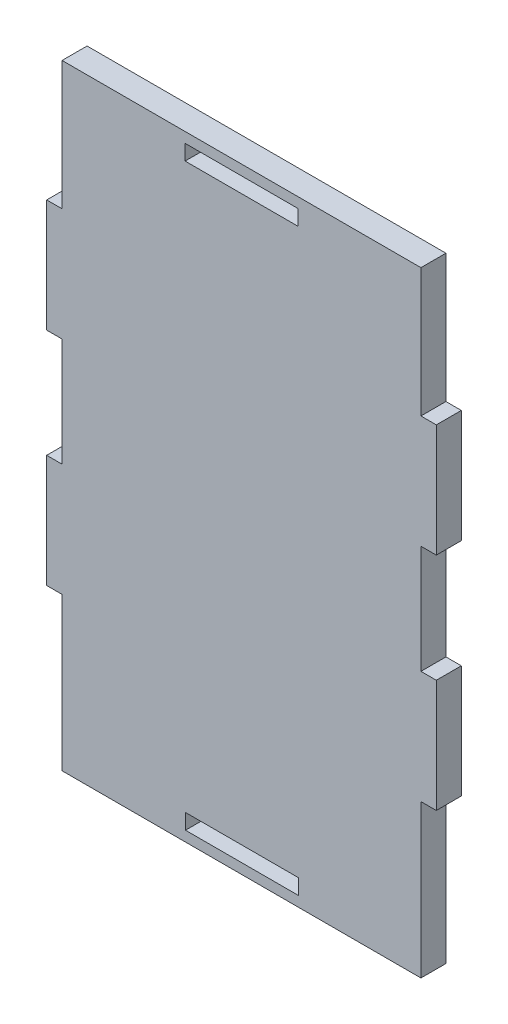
ISO-10303-21;
HEADER;
FILE_DESCRIPTION(('STEP AP214'),'2;1');
FILE_NAME('part.step','',(''),(''),'','','');
FILE_SCHEMA(('AUTOMOTIVE_DESIGN { 1 0 10303 214 1 1 1 1 }'));
ENDSEC;
DATA;
#1=APPLICATION_CONTEXT('core data for automotive mechanical design processes');
#2=APPLICATION_PROTOCOL_DEFINITION('international standard','automotive_design',2000,#1);
#3=PRODUCT_CONTEXT('',#1,'mechanical');
#4=PRODUCT('Part','Part','',(#3));
#5=PRODUCT_RELATED_PRODUCT_CATEGORY('part','',(#4));
#6=PRODUCT_DEFINITION_FORMATION('','',#4);
#7=PRODUCT_DEFINITION_CONTEXT('part definition',#1,'design');
#8=PRODUCT_DEFINITION('design','',#6,#7);
#9=PRODUCT_DEFINITION_SHAPE('','',#8);
#10=(LENGTH_UNIT() NAMED_UNIT(*) SI_UNIT(.MILLI.,.METRE.));
#11=(NAMED_UNIT(*) PLANE_ANGLE_UNIT() SI_UNIT($,.RADIAN.));
#12=(NAMED_UNIT(*) SI_UNIT($,.STERADIAN.) SOLID_ANGLE_UNIT());
#13=UNCERTAINTY_MEASURE_WITH_UNIT(LENGTH_MEASURE(1.E-05),#10,'distance_accuracy_value','');
#14=(GEOMETRIC_REPRESENTATION_CONTEXT(3) GLOBAL_UNCERTAINTY_ASSIGNED_CONTEXT((#13)) GLOBAL_UNIT_ASSIGNED_CONTEXT((#10,
#11,#12)) REPRESENTATION_CONTEXT('',''));
#15=CARTESIAN_POINT('',(0.,0.,0.));
#16=DIRECTION('',(0.,0.,1.));
#17=DIRECTION('',(1.,0.,0.));
#18=AXIS2_PLACEMENT_3D('',#15,#16,#17);
#19=CARTESIAN_POINT('',(0.,0.,4.87934888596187));
#20=DIRECTION('',(0.,0.,-1.));
#21=DIRECTION('',(-1.,0.,0.));
#22=AXIS2_PLACEMENT_3D('',#19,#20,#21);
#23=PLANE('',#22);
#24=DIRECTION('',(0.,-1.,0.));
#25=VECTOR('',#24,1.);
#26=CARTESIAN_POINT('',(23.9979341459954,-2.,4.87934888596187));
#27=LINE('',#26,#25);
#28=CARTESIAN_POINT('',(23.9979341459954,-2.,4.87934888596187));
#29=VERTEX_POINT('',#28);
#30=CARTESIAN_POINT('',(23.9979341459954,-5.,4.87934888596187));
#31=VERTEX_POINT('',#30);
#32=EDGE_CURVE('E256',#29,#31,#27,.T.);
#33=ORIENTED_EDGE('',*,*,#32,.F.);
#34=DIRECTION('',(-1.,0.,0.));
#35=VECTOR('',#34,1.);
#36=CARTESIAN_POINT('',(23.9979341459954,-2.,4.87934888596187));
#37=LINE('',#36,#35);
#38=CARTESIAN_POINT('',(45.9979341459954,-2.,4.87934888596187));
#39=VERTEX_POINT('',#38);
#40=EDGE_CURVE('E264',#39,#29,#37,.T.);
#41=ORIENTED_EDGE('',*,*,#40,.F.);
#42=DIRECTION('',(0.,1.,0.));
#43=VECTOR('',#42,1.);
#44=CARTESIAN_POINT('',(45.9979341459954,-2.,4.87934888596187));
#45=LINE('',#44,#43);
#46=CARTESIAN_POINT('',(45.9979341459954,-5.,4.87934888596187));
#47=VERTEX_POINT('',#46);
#48=EDGE_CURVE('E261',#47,#39,#45,.T.);
#49=ORIENTED_EDGE('',*,*,#48,.F.);
#50=DIRECTION('',(1.,0.,0.));
#51=VECTOR('',#50,1.);
#52=CARTESIAN_POINT('',(23.9979341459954,-5.,4.87934888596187));
#53=LINE('',#52,#51);
#54=EDGE_CURVE('E258',#31,#47,#53,.T.);
#55=ORIENTED_EDGE('',*,*,#54,.F.);
#56=EDGE_LOOP('',(#33,#41,#49,#55));
#57=FACE_BOUND('',#56,.T.);
#58=DIRECTION('',(0.,-1.,0.));
#59=VECTOR('',#58,1.);
#60=CARTESIAN_POINT('',(0.,0.,4.87934888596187));
#61=LINE('',#60,#59);
#62=CARTESIAN_POINT('',(0.,0.,4.87934888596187));
#63=VERTEX_POINT('',#62);
#64=CARTESIAN_POINT('',(0.,-25.06,4.87934888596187));
#65=VERTEX_POINT('',#64);
#66=EDGE_CURVE('E287',#63,#65,#61,.T.);
#67=ORIENTED_EDGE('',*,*,#66,.T.);
#68=DIRECTION('',(-1.,0.,0.));
#69=VECTOR('',#68,1.);
#70=CARTESIAN_POINT('',(0.,-25.06,4.87934888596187));
#71=LINE('',#70,#69);
#72=CARTESIAN_POINT('',(-3.,-25.06,4.87934888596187));
#73=VERTEX_POINT('',#72);
#74=EDGE_CURVE('E290',#65,#73,#71,.T.);
#75=ORIENTED_EDGE('',*,*,#74,.T.);
#76=DIRECTION('',(0.,-1.,0.));
#77=VECTOR('',#76,1.);
#78=CARTESIAN_POINT('',(-3.,-25.06,4.87934888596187));
#79=LINE('',#78,#77);
#80=CARTESIAN_POINT('',(-2.99999999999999,-47.06,4.87934888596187));
#81=VERTEX_POINT('',#80);
#82=EDGE_CURVE('E293',#73,#81,#79,.T.);
#83=ORIENTED_EDGE('',*,*,#82,.T.);
#84=DIRECTION('',(1.,0.,0.));
#85=VECTOR('',#84,1.);
#86=CARTESIAN_POINT('',(0.,-47.06,4.87934888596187));
#87=LINE('',#86,#85);
#88=CARTESIAN_POINT('',(0.,-47.06,4.87934888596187));
#89=VERTEX_POINT('',#88);
#90=EDGE_CURVE('E295',#81,#89,#87,.T.);
#91=ORIENTED_EDGE('',*,*,#90,.T.);
#92=DIRECTION('',(0.,-1.,0.));
#93=VECTOR('',#92,1.);
#94=CARTESIAN_POINT('',(0.,-47.06,4.87934888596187));
#95=LINE('',#94,#93);
#96=CARTESIAN_POINT('',(0.,-68.2,4.87934888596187));
#97=VERTEX_POINT('',#96);
#98=EDGE_CURVE('E297',#89,#97,#95,.T.);
#99=ORIENTED_EDGE('',*,*,#98,.T.);
#100=DIRECTION('',(-1.,0.,0.));
#101=VECTOR('',#100,1.);
#102=CARTESIAN_POINT('',(0.,-68.2,4.87934888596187));
#103=LINE('',#102,#101);
#104=CARTESIAN_POINT('',(-2.99999999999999,-68.2,4.87934888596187));
#105=VERTEX_POINT('',#104);
#106=EDGE_CURVE('E299',#97,#105,#103,.T.);
#107=ORIENTED_EDGE('',*,*,#106,.T.);
#108=DIRECTION('',(0.,-1.,0.));
#109=VECTOR('',#108,1.);
#110=CARTESIAN_POINT('',(-2.99999999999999,-68.2,4.87934888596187));
#111=LINE('',#110,#109);
#112=CARTESIAN_POINT('',(-2.99999999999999,-90.2,4.87934888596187));
#113=VERTEX_POINT('',#112);
#114=EDGE_CURVE('E301',#105,#113,#111,.T.);
#115=ORIENTED_EDGE('',*,*,#114,.T.);
#116=DIRECTION('',(1.,0.,0.));
#117=VECTOR('',#116,1.);
#118=CARTESIAN_POINT('',(0.,-90.2,4.87934888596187));
#119=LINE('',#118,#117);
#120=CARTESIAN_POINT('',(0.,-90.2,4.87934888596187));
#121=VERTEX_POINT('',#120);
#122=EDGE_CURVE('E303',#113,#121,#119,.T.);
#123=ORIENTED_EDGE('',*,*,#122,.T.);
#124=DIRECTION('',(0.,-1.,0.));
#125=VECTOR('',#124,1.);
#126=CARTESIAN_POINT('',(0.,-90.2,4.87934888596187));
#127=LINE('',#126,#125);
#128=CARTESIAN_POINT('',(0.,-120.,4.87934888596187));
#129=VERTEX_POINT('',#128);
#130=EDGE_CURVE('E305',#121,#129,#127,.T.);
#131=ORIENTED_EDGE('',*,*,#130,.T.);
#132=DIRECTION('',(1.,0.,0.));
#133=VECTOR('',#132,1.);
#134=CARTESIAN_POINT('',(0.,-120.,4.87934888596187));
#135=LINE('',#134,#133);
#136=CARTESIAN_POINT('',(70.,-120.,4.87934888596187));
#137=VERTEX_POINT('',#136);
#138=EDGE_CURVE('E307',#129,#137,#135,.T.);
#139=ORIENTED_EDGE('',*,*,#138,.T.);
#140=DIRECTION('',(0.,1.,0.));
#141=VECTOR('',#140,1.);
#142=CARTESIAN_POINT('',(70.,-90.1999999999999,4.87934888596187));
#143=LINE('',#142,#141);
#144=CARTESIAN_POINT('',(70.,-90.1999999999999,4.87934888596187));
#145=VERTEX_POINT('',#144);
#146=EDGE_CURVE('E309',#137,#145,#143,.T.);
#147=ORIENTED_EDGE('',*,*,#146,.T.);
#148=DIRECTION('',(1.,0.,0.));
#149=VECTOR('',#148,1.);
#150=CARTESIAN_POINT('',(70.,-90.1999999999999,4.87934888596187));
#151=LINE('',#150,#149);
#152=CARTESIAN_POINT('',(73.,-90.1999999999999,4.87934888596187));
#153=VERTEX_POINT('',#152);
#154=EDGE_CURVE('E311',#145,#153,#151,.T.);
#155=ORIENTED_EDGE('',*,*,#154,.T.);
#156=DIRECTION('',(0.,1.,0.));
#157=VECTOR('',#156,1.);
#158=CARTESIAN_POINT('',(73.,-68.2,4.87934888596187));
#159=LINE('',#158,#157);
#160=CARTESIAN_POINT('',(73.,-68.2,4.87934888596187));
#161=VERTEX_POINT('',#160);
#162=EDGE_CURVE('E313',#153,#161,#159,.T.);
#163=ORIENTED_EDGE('',*,*,#162,.T.);
#164=DIRECTION('',(-1.,0.,0.));
#165=VECTOR('',#164,1.);
#166=CARTESIAN_POINT('',(70.,-68.2,4.87934888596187));
#167=LINE('',#166,#165);
#168=CARTESIAN_POINT('',(70.,-68.2,4.87934888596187));
#169=VERTEX_POINT('',#168);
#170=EDGE_CURVE('E315',#161,#169,#167,.T.);
#171=ORIENTED_EDGE('',*,*,#170,.T.);
#172=DIRECTION('',(0.,1.,0.));
#173=VECTOR('',#172,1.);
#174=CARTESIAN_POINT('',(70.,-47.06,4.87934888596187));
#175=LINE('',#174,#173);
#176=CARTESIAN_POINT('',(70.,-47.06,4.87934888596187));
#177=VERTEX_POINT('',#176);
#178=EDGE_CURVE('E317',#169,#177,#175,.T.);
#179=ORIENTED_EDGE('',*,*,#178,.T.);
#180=DIRECTION('',(1.,0.,0.));
#181=VECTOR('',#180,1.);
#182=CARTESIAN_POINT('',(70.,-47.06,4.87934888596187));
#183=LINE('',#182,#181);
#184=CARTESIAN_POINT('',(73.,-47.06,4.87934888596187));
#185=VERTEX_POINT('',#184);
#186=EDGE_CURVE('E319',#177,#185,#183,.T.);
#187=ORIENTED_EDGE('',*,*,#186,.T.);
#188=DIRECTION('',(0.,1.,0.));
#189=VECTOR('',#188,1.);
#190=CARTESIAN_POINT('',(73.,-25.06,4.87934888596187));
#191=LINE('',#190,#189);
#192=CARTESIAN_POINT('',(73.,-25.06,4.87934888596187));
#193=VERTEX_POINT('',#192);
#194=EDGE_CURVE('E321',#185,#193,#191,.T.);
#195=ORIENTED_EDGE('',*,*,#194,.T.);
#196=DIRECTION('',(-1.,0.,0.));
#197=VECTOR('',#196,1.);
#198=CARTESIAN_POINT('',(70.,-25.06,4.87934888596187));
#199=LINE('',#198,#197);
#200=CARTESIAN_POINT('',(70.,-25.06,4.87934888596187));
#201=VERTEX_POINT('',#200);
#202=EDGE_CURVE('E323',#193,#201,#199,.T.);
#203=ORIENTED_EDGE('',*,*,#202,.T.);
#204=DIRECTION('',(0.,1.,0.));
#205=VECTOR('',#204,1.);
#206=CARTESIAN_POINT('',(70.,0.,4.87934888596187));
#207=LINE('',#206,#205);
#208=CARTESIAN_POINT('',(70.,0.,4.87934888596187));
#209=VERTEX_POINT('',#208);
#210=EDGE_CURVE('E325',#201,#209,#207,.T.);
#211=ORIENTED_EDGE('',*,*,#210,.T.);
#212=DIRECTION('',(-1.,0.,0.));
#213=VECTOR('',#212,1.);
#214=CARTESIAN_POINT('',(0.,0.,4.87934888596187));
#215=LINE('',#214,#213);
#216=EDGE_CURVE('E327',#209,#63,#215,.T.);
#217=ORIENTED_EDGE('',*,*,#216,.T.);
#218=EDGE_LOOP('',(#67,#75,#83,#91,#99,#107,#115,#123,#131,#139,#147,#155,#163,#171,#179,#187,
#195,#203,#211,#217));
#219=FACE_BOUND('',#218,.T.);
#220=DIRECTION('',(0.,-1.,0.));
#221=VECTOR('',#220,1.);
#222=CARTESIAN_POINT('',(24.0773037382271,-115.,4.87934888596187));
#223=LINE('',#222,#221);
#224=CARTESIAN_POINT('',(24.0773037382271,-115.,4.87934888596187));
#225=VERTEX_POINT('',#224);
#226=CARTESIAN_POINT('',(24.0773037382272,-118.,4.87934888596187));
#227=VERTEX_POINT('',#226);
#228=EDGE_CURVE('E220',#225,#227,#223,.T.);
#229=ORIENTED_EDGE('',*,*,#228,.F.);
#230=DIRECTION('',(-1.,0.,0.));
#231=VECTOR('',#230,1.);
#232=CARTESIAN_POINT('',(24.0773037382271,-115.,4.87934888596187));
#233=LINE('',#232,#231);
#234=CARTESIAN_POINT('',(46.0773037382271,-115.,4.87934888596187));
#235=VERTEX_POINT('',#234);
#236=EDGE_CURVE('E242',#235,#225,#233,.T.);
#237=ORIENTED_EDGE('',*,*,#236,.F.);
#238=DIRECTION('',(0.,1.,0.));
#239=VECTOR('',#238,1.);
#240=CARTESIAN_POINT('',(46.0773037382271,-115.,4.87934888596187));
#241=LINE('',#240,#239);
#242=CARTESIAN_POINT('',(46.0773037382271,-118.,4.87934888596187));
#243=VERTEX_POINT('',#242);
#244=EDGE_CURVE('E240',#243,#235,#241,.T.);
#245=ORIENTED_EDGE('',*,*,#244,.F.);
#246=DIRECTION('',(1.,0.,0.));
#247=VECTOR('',#246,1.);
#248=CARTESIAN_POINT('',(24.0773037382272,-118.,4.87934888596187));
#249=LINE('',#248,#247);
#250=EDGE_CURVE('E228',#227,#243,#249,.T.);
#251=ORIENTED_EDGE('',*,*,#250,.F.);
#252=EDGE_LOOP('',(#229,#237,#245,#251));
#253=FACE_BOUND('',#252,.T.);
#254=ADVANCED_FACE('F35',(#57,#219,#253),#23,.F.);
#255=CARTESIAN_POINT('',(0.,0.,0.));
#256=DIRECTION('',(0.,0.,-1.));
#257=DIRECTION('',(-1.,0.,0.));
#258=AXIS2_PLACEMENT_3D('',#255,#256,#257);
#259=PLANE('',#258);
#260=DIRECTION('',(0.,-1.,0.));
#261=VECTOR('',#260,1.);
#262=CARTESIAN_POINT('',(0.,0.,0.));
#263=LINE('',#262,#261);
#264=CARTESIAN_POINT('',(0.,0.,0.));
#265=VERTEX_POINT('',#264);
#266=CARTESIAN_POINT('',(0.,-25.06,0.));
#267=VERTEX_POINT('',#266);
#268=EDGE_CURVE('E286',#265,#267,#263,.T.);
#269=ORIENTED_EDGE('',*,*,#268,.F.);
#270=DIRECTION('',(-1.,0.,0.));
#271=VECTOR('',#270,1.);
#272=CARTESIAN_POINT('',(0.,0.,0.));
#273=LINE('',#272,#271);
#274=CARTESIAN_POINT('',(70.,0.,0.));
#275=VERTEX_POINT('',#274);
#276=EDGE_CURVE('E291',#275,#265,#273,.T.);
#277=ORIENTED_EDGE('',*,*,#276,.F.);
#278=DIRECTION('',(0.,1.,0.));
#279=VECTOR('',#278,1.);
#280=CARTESIAN_POINT('',(70.,0.,0.));
#281=LINE('',#280,#279);
#282=CARTESIAN_POINT('',(70.,-25.06,0.));
#283=VERTEX_POINT('',#282);
#284=EDGE_CURVE('E366',#283,#275,#281,.T.);
#285=ORIENTED_EDGE('',*,*,#284,.F.);
#286=DIRECTION('',(-1.,0.,0.));
#287=VECTOR('',#286,1.);
#288=CARTESIAN_POINT('',(70.,-25.06,0.));
#289=LINE('',#288,#287);
#290=CARTESIAN_POINT('',(73.,-25.06,0.));
#291=VERTEX_POINT('',#290);
#292=EDGE_CURVE('E364',#291,#283,#289,.T.);
#293=ORIENTED_EDGE('',*,*,#292,.F.);
#294=DIRECTION('',(0.,1.,0.));
#295=VECTOR('',#294,1.);
#296=CARTESIAN_POINT('',(73.,-25.06,0.));
#297=LINE('',#296,#295);
#298=CARTESIAN_POINT('',(73.,-47.06,0.));
#299=VERTEX_POINT('',#298);
#300=EDGE_CURVE('E362',#299,#291,#297,.T.);
#301=ORIENTED_EDGE('',*,*,#300,.F.);
#302=DIRECTION('',(1.,0.,0.));
#303=VECTOR('',#302,1.);
#304=CARTESIAN_POINT('',(70.,-47.06,0.));
#305=LINE('',#304,#303);
#306=CARTESIAN_POINT('',(70.,-47.06,0.));
#307=VERTEX_POINT('',#306);
#308=EDGE_CURVE('E360',#307,#299,#305,.T.);
#309=ORIENTED_EDGE('',*,*,#308,.F.);
#310=DIRECTION('',(0.,1.,0.));
#311=VECTOR('',#310,1.);
#312=CARTESIAN_POINT('',(70.,-47.06,0.));
#313=LINE('',#312,#311);
#314=CARTESIAN_POINT('',(70.,-68.2,0.));
#315=VERTEX_POINT('',#314);
#316=EDGE_CURVE('E358',#315,#307,#313,.T.);
#317=ORIENTED_EDGE('',*,*,#316,.F.);
#318=DIRECTION('',(-1.,0.,0.));
#319=VECTOR('',#318,1.);
#320=CARTESIAN_POINT('',(70.,-68.2,0.));
#321=LINE('',#320,#319);
#322=CARTESIAN_POINT('',(73.,-68.2,0.));
#323=VERTEX_POINT('',#322);
#324=EDGE_CURVE('E356',#323,#315,#321,.T.);
#325=ORIENTED_EDGE('',*,*,#324,.F.);
#326=DIRECTION('',(0.,1.,0.));
#327=VECTOR('',#326,1.);
#328=CARTESIAN_POINT('',(73.,-68.2,0.));
#329=LINE('',#328,#327);
#330=CARTESIAN_POINT('',(73.,-90.1999999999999,0.));
#331=VERTEX_POINT('',#330);
#332=EDGE_CURVE('E354',#331,#323,#329,.T.);
#333=ORIENTED_EDGE('',*,*,#332,.F.);
#334=DIRECTION('',(1.,0.,0.));
#335=VECTOR('',#334,1.);
#336=CARTESIAN_POINT('',(70.,-90.1999999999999,0.));
#337=LINE('',#336,#335);
#338=CARTESIAN_POINT('',(70.,-90.1999999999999,0.));
#339=VERTEX_POINT('',#338);
#340=EDGE_CURVE('E352',#339,#331,#337,.T.);
#341=ORIENTED_EDGE('',*,*,#340,.F.);
#342=DIRECTION('',(0.,1.,0.));
#343=VECTOR('',#342,1.);
#344=CARTESIAN_POINT('',(70.,-90.1999999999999,0.));
#345=LINE('',#344,#343);
#346=CARTESIAN_POINT('',(70.,-120.,0.));
#347=VERTEX_POINT('',#346);
#348=EDGE_CURVE('E350',#347,#339,#345,.T.);
#349=ORIENTED_EDGE('',*,*,#348,.F.);
#350=DIRECTION('',(1.,0.,0.));
#351=VECTOR('',#350,1.);
#352=CARTESIAN_POINT('',(0.,-120.,0.));
#353=LINE('',#352,#351);
#354=CARTESIAN_POINT('',(0.,-120.,0.));
#355=VERTEX_POINT('',#354);
#356=EDGE_CURVE('E348',#355,#347,#353,.T.);
#357=ORIENTED_EDGE('',*,*,#356,.F.);
#358=DIRECTION('',(0.,-1.,0.));
#359=VECTOR('',#358,1.);
#360=CARTESIAN_POINT('',(0.,-90.2,0.));
#361=LINE('',#360,#359);
#362=CARTESIAN_POINT('',(0.,-90.2,0.));
#363=VERTEX_POINT('',#362);
#364=EDGE_CURVE('E346',#363,#355,#361,.T.);
#365=ORIENTED_EDGE('',*,*,#364,.F.);
#366=DIRECTION('',(1.,0.,0.));
#367=VECTOR('',#366,1.);
#368=CARTESIAN_POINT('',(0.,-90.2,0.));
#369=LINE('',#368,#367);
#370=CARTESIAN_POINT('',(-2.99999999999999,-90.2,0.));
#371=VERTEX_POINT('',#370);
#372=EDGE_CURVE('E344',#371,#363,#369,.T.);
#373=ORIENTED_EDGE('',*,*,#372,.F.);
#374=DIRECTION('',(0.,-1.,0.));
#375=VECTOR('',#374,1.);
#376=CARTESIAN_POINT('',(-2.99999999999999,-68.2,0.));
#377=LINE('',#376,#375);
#378=CARTESIAN_POINT('',(-2.99999999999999,-68.2,0.));
#379=VERTEX_POINT('',#378);
#380=EDGE_CURVE('E342',#379,#371,#377,.T.);
#381=ORIENTED_EDGE('',*,*,#380,.F.);
#382=DIRECTION('',(-1.,0.,0.));
#383=VECTOR('',#382,1.);
#384=CARTESIAN_POINT('',(0.,-68.2,0.));
#385=LINE('',#384,#383);
#386=CARTESIAN_POINT('',(0.,-68.2,0.));
#387=VERTEX_POINT('',#386);
#388=EDGE_CURVE('E340',#387,#379,#385,.T.);
#389=ORIENTED_EDGE('',*,*,#388,.F.);
#390=DIRECTION('',(0.,-1.,0.));
#391=VECTOR('',#390,1.);
#392=CARTESIAN_POINT('',(0.,-47.06,0.));
#393=LINE('',#392,#391);
#394=CARTESIAN_POINT('',(0.,-47.06,0.));
#395=VERTEX_POINT('',#394);
#396=EDGE_CURVE('E338',#395,#387,#393,.T.);
#397=ORIENTED_EDGE('',*,*,#396,.F.);
#398=DIRECTION('',(1.,0.,0.));
#399=VECTOR('',#398,1.);
#400=CARTESIAN_POINT('',(0.,-47.06,0.));
#401=LINE('',#400,#399);
#402=CARTESIAN_POINT('',(-2.99999999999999,-47.06,0.));
#403=VERTEX_POINT('',#402);
#404=EDGE_CURVE('E336',#403,#395,#401,.T.);
#405=ORIENTED_EDGE('',*,*,#404,.F.);
#406=DIRECTION('',(0.,-1.,0.));
#407=VECTOR('',#406,1.);
#408=CARTESIAN_POINT('',(-3.,-25.06,0.));
#409=LINE('',#408,#407);
#410=CARTESIAN_POINT('',(-3.,-25.06,0.));
#411=VERTEX_POINT('',#410);
#412=EDGE_CURVE('E334',#411,#403,#409,.T.);
#413=ORIENTED_EDGE('',*,*,#412,.F.);
#414=DIRECTION('',(-1.,0.,0.));
#415=VECTOR('',#414,1.);
#416=CARTESIAN_POINT('',(0.,-25.06,0.));
#417=LINE('',#416,#415);
#418=EDGE_CURVE('E332',#267,#411,#417,.T.);
#419=ORIENTED_EDGE('',*,*,#418,.F.);
#420=EDGE_LOOP('',(#269,#277,#285,#293,#301,#309,#317,#325,#333,#341,#349,#357,#365,#373,#381,
#389,#397,#405,#413,#419));
#421=FACE_BOUND('',#420,.T.);
#422=DIRECTION('',(-1.,0.,0.));
#423=VECTOR('',#422,1.);
#424=CARTESIAN_POINT('',(23.9979341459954,-2.,0.));
#425=LINE('',#424,#423);
#426=CARTESIAN_POINT('',(45.9979341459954,-2.,0.));
#427=VERTEX_POINT('',#426);
#428=CARTESIAN_POINT('',(23.9979341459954,-2.,0.));
#429=VERTEX_POINT('',#428);
#430=EDGE_CURVE('E259',#427,#429,#425,.T.);
#431=ORIENTED_EDGE('',*,*,#430,.T.);
#432=DIRECTION('',(0.,-1.,0.));
#433=VECTOR('',#432,1.);
#434=CARTESIAN_POINT('',(23.9979341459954,-2.,0.));
#435=LINE('',#434,#433);
#436=CARTESIAN_POINT('',(23.9979341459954,-5.,0.));
#437=VERTEX_POINT('',#436);
#438=EDGE_CURVE('E236',#429,#437,#435,.T.);
#439=ORIENTED_EDGE('',*,*,#438,.T.);
#440=DIRECTION('',(1.,0.,0.));
#441=VECTOR('',#440,1.);
#442=CARTESIAN_POINT('',(23.9979341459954,-5.,0.));
#443=LINE('',#442,#441);
#444=CARTESIAN_POINT('',(45.9979341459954,-5.,0.));
#445=VERTEX_POINT('',#444);
#446=EDGE_CURVE('E269',#437,#445,#443,.T.);
#447=ORIENTED_EDGE('',*,*,#446,.T.);
#448=DIRECTION('',(0.,1.,0.));
#449=VECTOR('',#448,1.);
#450=CARTESIAN_POINT('',(45.9979341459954,-2.,0.));
#451=LINE('',#450,#449);
#452=EDGE_CURVE('E272',#445,#427,#451,.T.);
#453=ORIENTED_EDGE('',*,*,#452,.T.);
#454=EDGE_LOOP('',(#431,#439,#447,#453));
#455=FACE_BOUND('',#454,.T.);
#456=DIRECTION('',(-1.,0.,0.));
#457=VECTOR('',#456,1.);
#458=CARTESIAN_POINT('',(24.0773037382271,-115.,0.));
#459=LINE('',#458,#457);
#460=CARTESIAN_POINT('',(46.0773037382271,-115.,0.));
#461=VERTEX_POINT('',#460);
#462=CARTESIAN_POINT('',(24.0773037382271,-115.,0.));
#463=VERTEX_POINT('',#462);
#464=EDGE_CURVE('E229',#461,#463,#459,.T.);
#465=ORIENTED_EDGE('',*,*,#464,.T.);
#466=DIRECTION('',(0.,-1.,0.));
#467=VECTOR('',#466,1.);
#468=CARTESIAN_POINT('',(24.0773037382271,-115.,0.));
#469=LINE('',#468,#467);
#470=CARTESIAN_POINT('',(24.0773037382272,-118.,0.));
#471=VERTEX_POINT('',#470);
#472=EDGE_CURVE('E58',#463,#471,#469,.T.);
#473=ORIENTED_EDGE('',*,*,#472,.T.);
#474=DIRECTION('',(1.,0.,0.));
#475=VECTOR('',#474,1.);
#476=CARTESIAN_POINT('',(24.0773037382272,-118.,0.));
#477=LINE('',#476,#475);
#478=CARTESIAN_POINT('',(46.0773037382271,-118.,0.));
#479=VERTEX_POINT('',#478);
#480=EDGE_CURVE('E235',#471,#479,#477,.T.);
#481=ORIENTED_EDGE('',*,*,#480,.T.);
#482=DIRECTION('',(0.,1.,0.));
#483=VECTOR('',#482,1.);
#484=CARTESIAN_POINT('',(46.0773037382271,-115.,0.));
#485=LINE('',#484,#483);
#486=EDGE_CURVE('E248',#479,#461,#485,.T.);
#487=ORIENTED_EDGE('',*,*,#486,.T.);
#488=EDGE_LOOP('',(#465,#473,#481,#487));
#489=FACE_BOUND('',#488,.T.);
#490=ADVANCED_FACE('F432',(#421,#455,#489),#259,.T.);
#491=CARTESIAN_POINT('',(0.,0.,4.87934888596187));
#492=DIRECTION('',(1.,0.,0.));
#493=DIRECTION('',(0.,1.,0.));
#494=AXIS2_PLACEMENT_3D('',#491,#492,#493);
#495=PLANE('',#494);
#496=ORIENTED_EDGE('',*,*,#268,.T.);
#497=DIRECTION('',(0.,0.,-1.));
#498=VECTOR('',#497,1.);
#499=CARTESIAN_POINT('',(0.,-25.06,4.87934888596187));
#500=LINE('',#499,#498);
#501=EDGE_CURVE('E11',#65,#267,#500,.T.);
#502=ORIENTED_EDGE('',*,*,#501,.F.);
#503=ORIENTED_EDGE('',*,*,#66,.F.);
#504=DIRECTION('',(0.,0.,-1.));
#505=VECTOR('',#504,1.);
#506=CARTESIAN_POINT('',(0.,0.,4.87934888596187));
#507=LINE('',#506,#505);
#508=EDGE_CURVE('E329',#63,#265,#507,.T.);
#509=ORIENTED_EDGE('',*,*,#508,.T.);
#510=EDGE_LOOP('',(#496,#502,#503,#509));
#511=FACE_BOUND('',#510,.T.);
#512=ADVANCED_FACE('F37',(#511),#495,.F.);
#513=CARTESIAN_POINT('',(0.,-25.06,4.87934888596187));
#514=DIRECTION('',(0.,-1.,0.));
#515=DIRECTION('',(0.,0.,-1.));
#516=AXIS2_PLACEMENT_3D('',#513,#514,#515);
#517=PLANE('',#516);
#518=ORIENTED_EDGE('',*,*,#418,.T.);
#519=DIRECTION('',(0.,0.,-1.));
#520=VECTOR('',#519,1.);
#521=CARTESIAN_POINT('',(-3.,-25.06,4.87934888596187));
#522=LINE('',#521,#520);
#523=EDGE_CURVE('E43',#73,#411,#522,.T.);
#524=ORIENTED_EDGE('',*,*,#523,.F.);
#525=ORIENTED_EDGE('',*,*,#74,.F.);
#526=ORIENTED_EDGE('',*,*,#501,.T.);
#527=EDGE_LOOP('',(#518,#524,#525,#526));
#528=FACE_BOUND('',#527,.T.);
#529=ADVANCED_FACE('F449',(#528),#517,.F.);
#530=CARTESIAN_POINT('',(-3.,-25.06,4.87934888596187));
#531=DIRECTION('',(1.,0.,0.));
#532=DIRECTION('',(0.,1.,0.));
#533=AXIS2_PLACEMENT_3D('',#530,#531,#532);
#534=PLANE('',#533);
#535=ORIENTED_EDGE('',*,*,#412,.T.);
#536=DIRECTION('',(0.,0.,-1.));
#537=VECTOR('',#536,1.);
#538=CARTESIAN_POINT('',(-2.99999999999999,-47.06,4.87934888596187));
#539=LINE('',#538,#537);
#540=EDGE_CURVE('E419',#81,#403,#539,.T.);
#541=ORIENTED_EDGE('',*,*,#540,.F.);
#542=ORIENTED_EDGE('',*,*,#82,.F.);
#543=ORIENTED_EDGE('',*,*,#523,.T.);
#544=EDGE_LOOP('',(#535,#541,#542,#543));
#545=FACE_BOUND('',#544,.T.);
#546=ADVANCED_FACE('F426',(#545),#534,.F.);
#547=CARTESIAN_POINT('',(0.,-47.06,4.87934888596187));
#548=DIRECTION('',(0.,1.,0.));
#549=DIRECTION('',(0.,0.,1.));
#550=AXIS2_PLACEMENT_3D('',#547,#548,#549);
#551=PLANE('',#550);
#552=ORIENTED_EDGE('',*,*,#404,.T.);
#553=DIRECTION('',(0.,0.,-1.));
#554=VECTOR('',#553,1.);
#555=CARTESIAN_POINT('',(0.,-47.06,4.87934888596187));
#556=LINE('',#555,#554);
#557=EDGE_CURVE('E416',#89,#395,#556,.T.);
#558=ORIENTED_EDGE('',*,*,#557,.F.);
#559=ORIENTED_EDGE('',*,*,#90,.F.);
#560=ORIENTED_EDGE('',*,*,#540,.T.);
#561=EDGE_LOOP('',(#552,#558,#559,#560));
#562=FACE_BOUND('',#561,.T.);
#563=ADVANCED_FACE('F438',(#562),#551,.F.);
#564=CARTESIAN_POINT('',(0.,-47.06,4.87934888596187));
#565=DIRECTION('',(1.,0.,0.));
#566=DIRECTION('',(0.,1.,0.));
#567=AXIS2_PLACEMENT_3D('',#564,#565,#566);
#568=PLANE('',#567);
#569=ORIENTED_EDGE('',*,*,#396,.T.);
#570=DIRECTION('',(0.,0.,-1.));
#571=VECTOR('',#570,1.);
#572=CARTESIAN_POINT('',(0.,-68.2,4.87934888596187));
#573=LINE('',#572,#571);
#574=EDGE_CURVE('E413',#97,#387,#573,.T.);
#575=ORIENTED_EDGE('',*,*,#574,.F.);
#576=ORIENTED_EDGE('',*,*,#98,.F.);
#577=ORIENTED_EDGE('',*,*,#557,.T.);
#578=EDGE_LOOP('',(#569,#575,#576,#577));
#579=FACE_BOUND('',#578,.T.);
#580=ADVANCED_FACE('F442',(#579),#568,.F.);
#581=CARTESIAN_POINT('',(0.,-68.2,4.87934888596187));
#582=DIRECTION('',(0.,-1.,0.));
#583=DIRECTION('',(0.,0.,-1.));
#584=AXIS2_PLACEMENT_3D('',#581,#582,#583);
#585=PLANE('',#584);
#586=ORIENTED_EDGE('',*,*,#388,.T.);
#587=DIRECTION('',(0.,0.,-1.));
#588=VECTOR('',#587,1.);
#589=CARTESIAN_POINT('',(-2.99999999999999,-68.2,4.87934888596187));
#590=LINE('',#589,#588);
#591=EDGE_CURVE('E410',#105,#379,#590,.T.);
#592=ORIENTED_EDGE('',*,*,#591,.F.);
#593=ORIENTED_EDGE('',*,*,#106,.F.);
#594=ORIENTED_EDGE('',*,*,#574,.T.);
#595=EDGE_LOOP('',(#586,#592,#593,#594));
#596=FACE_BOUND('',#595,.T.);
#597=ADVANCED_FACE('F522',(#596),#585,.F.);
#598=CARTESIAN_POINT('',(-2.99999999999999,-68.2,4.87934888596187));
#599=DIRECTION('',(1.,0.,0.));
#600=DIRECTION('',(0.,1.,0.));
#601=AXIS2_PLACEMENT_3D('',#598,#599,#600);
#602=PLANE('',#601);
#603=ORIENTED_EDGE('',*,*,#380,.T.);
#604=DIRECTION('',(0.,0.,-1.));
#605=VECTOR('',#604,1.);
#606=CARTESIAN_POINT('',(-2.99999999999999,-90.2,4.87934888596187));
#607=LINE('',#606,#605);
#608=EDGE_CURVE('E407',#113,#371,#607,.T.);
#609=ORIENTED_EDGE('',*,*,#608,.F.);
#610=ORIENTED_EDGE('',*,*,#114,.F.);
#611=ORIENTED_EDGE('',*,*,#591,.T.);
#612=EDGE_LOOP('',(#603,#609,#610,#611));
#613=FACE_BOUND('',#612,.T.);
#614=ADVANCED_FACE('F520',(#613),#602,.F.);
#615=CARTESIAN_POINT('',(0.,-90.2,4.87934888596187));
#616=DIRECTION('',(0.,1.,0.));
#617=DIRECTION('',(0.,0.,1.));
#618=AXIS2_PLACEMENT_3D('',#615,#616,#617);
#619=PLANE('',#618);
#620=ORIENTED_EDGE('',*,*,#372,.T.);
#621=DIRECTION('',(0.,0.,-1.));
#622=VECTOR('',#621,1.);
#623=CARTESIAN_POINT('',(0.,-90.2,4.87934888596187));
#624=LINE('',#623,#622);
#625=EDGE_CURVE('E404',#121,#363,#624,.T.);
#626=ORIENTED_EDGE('',*,*,#625,.F.);
#627=ORIENTED_EDGE('',*,*,#122,.F.);
#628=ORIENTED_EDGE('',*,*,#608,.T.);
#629=EDGE_LOOP('',(#620,#626,#627,#628));
#630=FACE_BOUND('',#629,.T.);
#631=ADVANCED_FACE('F515',(#630),#619,.F.);
#632=CARTESIAN_POINT('',(0.,-90.2,4.87934888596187));
#633=DIRECTION('',(1.,0.,0.));
#634=DIRECTION('',(0.,1.,0.));
#635=AXIS2_PLACEMENT_3D('',#632,#633,#634);
#636=PLANE('',#635);
#637=ORIENTED_EDGE('',*,*,#364,.T.);
#638=DIRECTION('',(0.,0.,-1.));
#639=VECTOR('',#638,1.);
#640=CARTESIAN_POINT('',(0.,-120.,4.87934888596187));
#641=LINE('',#640,#639);
#642=EDGE_CURVE('E401',#129,#355,#641,.T.);
#643=ORIENTED_EDGE('',*,*,#642,.F.);
#644=ORIENTED_EDGE('',*,*,#130,.F.);
#645=ORIENTED_EDGE('',*,*,#625,.T.);
#646=EDGE_LOOP('',(#637,#643,#644,#645));
#647=FACE_BOUND('',#646,.T.);
#648=ADVANCED_FACE('F510',(#647),#636,.F.);
#649=CARTESIAN_POINT('',(0.,-120.,4.87934888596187));
#650=DIRECTION('',(0.,1.,0.));
#651=DIRECTION('',(0.,0.,1.));
#652=AXIS2_PLACEMENT_3D('',#649,#650,#651);
#653=PLANE('',#652);
#654=ORIENTED_EDGE('',*,*,#356,.T.);
#655=DIRECTION('',(0.,0.,-1.));
#656=VECTOR('',#655,1.);
#657=CARTESIAN_POINT('',(70.,-120.,4.87934888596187));
#658=LINE('',#657,#656);
#659=EDGE_CURVE('E398',#137,#347,#658,.T.);
#660=ORIENTED_EDGE('',*,*,#659,.F.);
#661=ORIENTED_EDGE('',*,*,#138,.F.);
#662=ORIENTED_EDGE('',*,*,#642,.T.);
#663=EDGE_LOOP('',(#654,#660,#661,#662));
#664=FACE_BOUND('',#663,.T.);
#665=ADVANCED_FACE('F506',(#664),#653,.F.);
#666=CARTESIAN_POINT('',(70.,-90.1999999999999,4.87934888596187));
#667=DIRECTION('',(-1.,0.,0.));
#668=DIRECTION('',(0.,-1.,0.));
#669=AXIS2_PLACEMENT_3D('',#666,#667,#668);
#670=PLANE('',#669);
#671=ORIENTED_EDGE('',*,*,#348,.T.);
#672=DIRECTION('',(0.,0.,-1.));
#673=VECTOR('',#672,1.);
#674=CARTESIAN_POINT('',(70.,-90.1999999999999,4.87934888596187));
#675=LINE('',#674,#673);
#676=EDGE_CURVE('E395',#145,#339,#675,.T.);
#677=ORIENTED_EDGE('',*,*,#676,.F.);
#678=ORIENTED_EDGE('',*,*,#146,.F.);
#679=ORIENTED_EDGE('',*,*,#659,.T.);
#680=EDGE_LOOP('',(#671,#677,#678,#679));
#681=FACE_BOUND('',#680,.T.);
#682=ADVANCED_FACE('F501',(#681),#670,.F.);
#683=CARTESIAN_POINT('',(70.,-90.1999999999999,4.87934888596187));
#684=DIRECTION('',(0.,1.,0.));
#685=DIRECTION('',(0.,0.,1.));
#686=AXIS2_PLACEMENT_3D('',#683,#684,#685);
#687=PLANE('',#686);
#688=ORIENTED_EDGE('',*,*,#340,.T.);
#689=DIRECTION('',(0.,0.,-1.));
#690=VECTOR('',#689,1.);
#691=CARTESIAN_POINT('',(73.,-90.1999999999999,4.87934888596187));
#692=LINE('',#691,#690);
#693=EDGE_CURVE('E392',#153,#331,#692,.T.);
#694=ORIENTED_EDGE('',*,*,#693,.F.);
#695=ORIENTED_EDGE('',*,*,#154,.F.);
#696=ORIENTED_EDGE('',*,*,#676,.T.);
#697=EDGE_LOOP('',(#688,#694,#695,#696));
#698=FACE_BOUND('',#697,.T.);
#699=ADVANCED_FACE('F495',(#698),#687,.F.);
#700=CARTESIAN_POINT('',(73.,-68.2,4.87934888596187));
#701=DIRECTION('',(-1.,0.,0.));
#702=DIRECTION('',(0.,0.,1.));
#703=AXIS2_PLACEMENT_3D('',#700,#701,#702);
#704=PLANE('',#703);
#705=ORIENTED_EDGE('',*,*,#332,.T.);
#706=DIRECTION('',(0.,0.,-1.));
#707=VECTOR('',#706,1.);
#708=CARTESIAN_POINT('',(73.,-68.2,4.87934888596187));
#709=LINE('',#708,#707);
#710=EDGE_CURVE('E389',#161,#323,#709,.T.);
#711=ORIENTED_EDGE('',*,*,#710,.F.);
#712=ORIENTED_EDGE('',*,*,#162,.F.);
#713=ORIENTED_EDGE('',*,*,#693,.T.);
#714=EDGE_LOOP('',(#705,#711,#712,#713));
#715=FACE_BOUND('',#714,.T.);
#716=ADVANCED_FACE('F491',(#715),#704,.F.);
#717=CARTESIAN_POINT('',(70.,-68.2,4.87934888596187));
#718=DIRECTION('',(0.,-1.,0.));
#719=DIRECTION('',(0.,0.,-1.));
#720=AXIS2_PLACEMENT_3D('',#717,#718,#719);
#721=PLANE('',#720);
#722=ORIENTED_EDGE('',*,*,#324,.T.);
#723=DIRECTION('',(0.,0.,-1.));
#724=VECTOR('',#723,1.);
#725=CARTESIAN_POINT('',(70.,-68.2,4.87934888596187));
#726=LINE('',#725,#724);
#727=EDGE_CURVE('E386',#169,#315,#726,.T.);
#728=ORIENTED_EDGE('',*,*,#727,.F.);
#729=ORIENTED_EDGE('',*,*,#170,.F.);
#730=ORIENTED_EDGE('',*,*,#710,.T.);
#731=EDGE_LOOP('',(#722,#728,#729,#730));
#732=FACE_BOUND('',#731,.T.);
#733=ADVANCED_FACE('F486',(#732),#721,.F.);
#734=CARTESIAN_POINT('',(70.,-47.06,4.87934888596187));
#735=DIRECTION('',(-1.,0.,0.));
#736=DIRECTION('',(0.,-1.,0.));
#737=AXIS2_PLACEMENT_3D('',#734,#735,#736);
#738=PLANE('',#737);
#739=ORIENTED_EDGE('',*,*,#316,.T.);
#740=DIRECTION('',(0.,0.,-1.));
#741=VECTOR('',#740,1.);
#742=CARTESIAN_POINT('',(70.,-47.06,4.87934888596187));
#743=LINE('',#742,#741);
#744=EDGE_CURVE('E383',#177,#307,#743,.T.);
#745=ORIENTED_EDGE('',*,*,#744,.F.);
#746=ORIENTED_EDGE('',*,*,#178,.F.);
#747=ORIENTED_EDGE('',*,*,#727,.T.);
#748=EDGE_LOOP('',(#739,#745,#746,#747));
#749=FACE_BOUND('',#748,.T.);
#750=ADVANCED_FACE('F480',(#749),#738,.F.);
#751=CARTESIAN_POINT('',(70.,-47.06,4.87934888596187));
#752=DIRECTION('',(0.,1.,0.));
#753=DIRECTION('',(0.,0.,1.));
#754=AXIS2_PLACEMENT_3D('',#751,#752,#753);
#755=PLANE('',#754);
#756=ORIENTED_EDGE('',*,*,#308,.T.);
#757=DIRECTION('',(0.,0.,-1.));
#758=VECTOR('',#757,1.);
#759=CARTESIAN_POINT('',(73.,-47.06,4.87934888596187));
#760=LINE('',#759,#758);
#761=EDGE_CURVE('E380',#185,#299,#760,.T.);
#762=ORIENTED_EDGE('',*,*,#761,.F.);
#763=ORIENTED_EDGE('',*,*,#186,.F.);
#764=ORIENTED_EDGE('',*,*,#744,.T.);
#765=EDGE_LOOP('',(#756,#762,#763,#764));
#766=FACE_BOUND('',#765,.T.);
#767=ADVANCED_FACE('F476',(#766),#755,.F.);
#768=CARTESIAN_POINT('',(73.,-25.06,4.87934888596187));
#769=DIRECTION('',(-1.,0.,0.));
#770=DIRECTION('',(0.,-1.,0.));
#771=AXIS2_PLACEMENT_3D('',#768,#769,#770);
#772=PLANE('',#771);
#773=ORIENTED_EDGE('',*,*,#300,.T.);
#774=DIRECTION('',(0.,0.,-1.));
#775=VECTOR('',#774,1.);
#776=CARTESIAN_POINT('',(73.,-25.06,4.87934888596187));
#777=LINE('',#776,#775);
#778=EDGE_CURVE('E377',#193,#291,#777,.T.);
#779=ORIENTED_EDGE('',*,*,#778,.F.);
#780=ORIENTED_EDGE('',*,*,#194,.F.);
#781=ORIENTED_EDGE('',*,*,#761,.T.);
#782=EDGE_LOOP('',(#773,#779,#780,#781));
#783=FACE_BOUND('',#782,.T.);
#784=ADVANCED_FACE('F471',(#783),#772,.F.);
#785=CARTESIAN_POINT('',(70.,-25.06,4.87934888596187));
#786=DIRECTION('',(0.,-1.,0.));
#787=DIRECTION('',(0.,0.,-1.));
#788=AXIS2_PLACEMENT_3D('',#785,#786,#787);
#789=PLANE('',#788);
#790=ORIENTED_EDGE('',*,*,#292,.T.);
#791=DIRECTION('',(0.,0.,-1.));
#792=VECTOR('',#791,1.);
#793=CARTESIAN_POINT('',(70.,-25.06,4.87934888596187));
#794=LINE('',#793,#792);
#795=EDGE_CURVE('E374',#201,#283,#794,.T.);
#796=ORIENTED_EDGE('',*,*,#795,.F.);
#797=ORIENTED_EDGE('',*,*,#202,.F.);
#798=ORIENTED_EDGE('',*,*,#778,.T.);
#799=EDGE_LOOP('',(#790,#796,#797,#798));
#800=FACE_BOUND('',#799,.T.);
#801=ADVANCED_FACE('F465',(#800),#789,.F.);
#802=CARTESIAN_POINT('',(70.,0.,4.87934888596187));
#803=DIRECTION('',(-1.,0.,0.));
#804=DIRECTION('',(0.,0.,1.));
#805=AXIS2_PLACEMENT_3D('',#802,#803,#804);
#806=PLANE('',#805);
#807=ORIENTED_EDGE('',*,*,#284,.T.);
#808=DIRECTION('',(0.,0.,-1.));
#809=VECTOR('',#808,1.);
#810=CARTESIAN_POINT('',(70.,0.,4.87934888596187));
#811=LINE('',#810,#809);
#812=EDGE_CURVE('E371',#209,#275,#811,.T.);
#813=ORIENTED_EDGE('',*,*,#812,.F.);
#814=ORIENTED_EDGE('',*,*,#210,.F.);
#815=ORIENTED_EDGE('',*,*,#795,.T.);
#816=EDGE_LOOP('',(#807,#813,#814,#815));
#817=FACE_BOUND('',#816,.T.);
#818=ADVANCED_FACE('F461',(#817),#806,.F.);
#819=CARTESIAN_POINT('',(0.,0.,4.87934888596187));
#820=DIRECTION('',(0.,-1.,0.));
#821=DIRECTION('',(0.,0.,-1.));
#822=AXIS2_PLACEMENT_3D('',#819,#820,#821);
#823=PLANE('',#822);
#824=ORIENTED_EDGE('',*,*,#276,.T.);
#825=ORIENTED_EDGE('',*,*,#508,.F.);
#826=ORIENTED_EDGE('',*,*,#216,.F.);
#827=ORIENTED_EDGE('',*,*,#812,.T.);
#828=EDGE_LOOP('',(#824,#825,#826,#827));
#829=FACE_BOUND('',#828,.T.);
#830=ADVANCED_FACE('F456',(#829),#823,.F.);
#831=CARTESIAN_POINT('',(23.9979341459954,-2.,4.87934888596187));
#832=DIRECTION('',(1.,0.,0.));
#833=DIRECTION('',(0.,0.,-1.));
#834=AXIS2_PLACEMENT_3D('',#831,#832,#833);
#835=PLANE('',#834);
#836=ORIENTED_EDGE('',*,*,#438,.F.);
#837=DIRECTION('',(0.,0.,-1.));
#838=VECTOR('',#837,1.);
#839=CARTESIAN_POINT('',(23.9979341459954,-2.,4.87934888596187));
#840=LINE('',#839,#838);
#841=EDGE_CURVE('E266',#29,#429,#840,.T.);
#842=ORIENTED_EDGE('',*,*,#841,.F.);
#843=ORIENTED_EDGE('',*,*,#32,.T.);
#844=DIRECTION('',(0.,0.,-1.));
#845=VECTOR('',#844,1.);
#846=CARTESIAN_POINT('',(23.9979341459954,-5.,4.87934888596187));
#847=LINE('',#846,#845);
#848=EDGE_CURVE('E283',#31,#437,#847,.T.);
#849=ORIENTED_EDGE('',*,*,#848,.T.);
#850=EDGE_LOOP('',(#836,#842,#843,#849));
#851=FACE_BOUND('',#850,.T.);
#852=ADVANCED_FACE('F540',(#851),#835,.T.);
#853=CARTESIAN_POINT('',(23.9979341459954,-5.,4.87934888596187));
#854=DIRECTION('',(0.,1.,0.));
#855=DIRECTION('',(0.,0.,1.));
#856=AXIS2_PLACEMENT_3D('',#853,#854,#855);
#857=PLANE('',#856);
#858=ORIENTED_EDGE('',*,*,#446,.F.);
#859=ORIENTED_EDGE('',*,*,#848,.F.);
#860=ORIENTED_EDGE('',*,*,#54,.T.);
#861=DIRECTION('',(0.,0.,-1.));
#862=VECTOR('',#861,1.);
#863=CARTESIAN_POINT('',(45.9979341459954,-5.,4.87934888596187));
#864=LINE('',#863,#862);
#865=EDGE_CURVE('E281',#47,#445,#864,.T.);
#866=ORIENTED_EDGE('',*,*,#865,.T.);
#867=EDGE_LOOP('',(#858,#859,#860,#866));
#868=FACE_BOUND('',#867,.T.);
#869=ADVANCED_FACE('F626',(#868),#857,.T.);
#870=CARTESIAN_POINT('',(45.9979341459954,-2.,4.87934888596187));
#871=DIRECTION('',(-1.,0.,0.));
#872=DIRECTION('',(0.,-1.,0.));
#873=AXIS2_PLACEMENT_3D('',#870,#871,#872);
#874=PLANE('',#873);
#875=ORIENTED_EDGE('',*,*,#452,.F.);
#876=ORIENTED_EDGE('',*,*,#865,.F.);
#877=ORIENTED_EDGE('',*,*,#48,.T.);
#878=DIRECTION('',(0.,0.,-1.));
#879=VECTOR('',#878,1.);
#880=CARTESIAN_POINT('',(45.9979341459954,-2.,4.87934888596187));
#881=LINE('',#880,#879);
#882=EDGE_CURVE('E279',#39,#427,#881,.T.);
#883=ORIENTED_EDGE('',*,*,#882,.T.);
#884=EDGE_LOOP('',(#875,#876,#877,#883));
#885=FACE_BOUND('',#884,.T.);
#886=ADVANCED_FACE('F633',(#885),#874,.T.);
#887=CARTESIAN_POINT('',(23.9979341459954,-2.,4.87934888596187));
#888=DIRECTION('',(0.,-1.,0.));
#889=DIRECTION('',(1.,0.,0.));
#890=AXIS2_PLACEMENT_3D('',#887,#888,#889);
#891=PLANE('',#890);
#892=ORIENTED_EDGE('',*,*,#430,.F.);
#893=ORIENTED_EDGE('',*,*,#882,.F.);
#894=ORIENTED_EDGE('',*,*,#40,.T.);
#895=ORIENTED_EDGE('',*,*,#841,.T.);
#896=EDGE_LOOP('',(#892,#893,#894,#895));
#897=FACE_BOUND('',#896,.T.);
#898=ADVANCED_FACE('F640',(#897),#891,.T.);
#899=CARTESIAN_POINT('',(24.0773037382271,-115.,4.87934888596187));
#900=DIRECTION('',(1.,0.,0.));
#901=DIRECTION('',(0.,1.,0.));
#902=AXIS2_PLACEMENT_3D('',#899,#900,#901);
#903=PLANE('',#902);
#904=ORIENTED_EDGE('',*,*,#472,.F.);
#905=DIRECTION('',(0.,0.,-1.));
#906=VECTOR('',#905,1.);
#907=CARTESIAN_POINT('',(24.0773037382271,-115.,4.87934888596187));
#908=LINE('',#907,#906);
#909=EDGE_CURVE('E224',#225,#463,#908,.T.);
#910=ORIENTED_EDGE('',*,*,#909,.F.);
#911=ORIENTED_EDGE('',*,*,#228,.T.);
#912=DIRECTION('',(0.,0.,-1.));
#913=VECTOR('',#912,1.);
#914=CARTESIAN_POINT('',(24.0773037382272,-118.,4.87934888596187));
#915=LINE('',#914,#913);
#916=EDGE_CURVE('E223',#227,#471,#915,.T.);
#917=ORIENTED_EDGE('',*,*,#916,.T.);
#918=EDGE_LOOP('',(#904,#910,#911,#917));
#919=FACE_BOUND('',#918,.T.);
#920=ADVANCED_FACE('F222',(#919),#903,.T.);
#921=CARTESIAN_POINT('',(24.0773037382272,-118.,4.87934888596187));
#922=DIRECTION('',(0.,1.,0.));
#923=DIRECTION('',(0.,0.,1.));
#924=AXIS2_PLACEMENT_3D('',#921,#922,#923);
#925=PLANE('',#924);
#926=ORIENTED_EDGE('',*,*,#480,.F.);
#927=ORIENTED_EDGE('',*,*,#916,.F.);
#928=ORIENTED_EDGE('',*,*,#250,.T.);
#929=DIRECTION('',(0.,0.,-1.));
#930=VECTOR('',#929,1.);
#931=CARTESIAN_POINT('',(46.0773037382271,-118.,4.87934888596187));
#932=LINE('',#931,#930);
#933=EDGE_CURVE('E237',#243,#479,#932,.T.);
#934=ORIENTED_EDGE('',*,*,#933,.T.);
#935=EDGE_LOOP('',(#926,#927,#928,#934));
#936=FACE_BOUND('',#935,.T.);
#937=ADVANCED_FACE('F232',(#936),#925,.T.);
#938=CARTESIAN_POINT('',(46.0773037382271,-115.,4.87934888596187));
#939=DIRECTION('',(-1.,0.,0.));
#940=DIRECTION('',(0.,0.,1.));
#941=AXIS2_PLACEMENT_3D('',#938,#939,#940);
#942=PLANE('',#941);
#943=ORIENTED_EDGE('',*,*,#486,.F.);
#944=ORIENTED_EDGE('',*,*,#933,.F.);
#945=ORIENTED_EDGE('',*,*,#244,.T.);
#946=DIRECTION('',(0.,0.,-1.));
#947=VECTOR('',#946,1.);
#948=CARTESIAN_POINT('',(46.0773037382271,-115.,4.87934888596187));
#949=LINE('',#948,#947);
#950=EDGE_CURVE('E50',#235,#461,#949,.T.);
#951=ORIENTED_EDGE('',*,*,#950,.T.);
#952=EDGE_LOOP('',(#943,#944,#945,#951));
#953=FACE_BOUND('',#952,.T.);
#954=ADVANCED_FACE('F661',(#953),#942,.T.);
#955=CARTESIAN_POINT('',(24.0773037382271,-115.,4.87934888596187));
#956=DIRECTION('',(0.,-1.,0.));
#957=DIRECTION('',(0.,0.,-1.));
#958=AXIS2_PLACEMENT_3D('',#955,#956,#957);
#959=PLANE('',#958);
#960=ORIENTED_EDGE('',*,*,#464,.F.);
#961=ORIENTED_EDGE('',*,*,#950,.F.);
#962=ORIENTED_EDGE('',*,*,#236,.T.);
#963=ORIENTED_EDGE('',*,*,#909,.T.);
#964=EDGE_LOOP('',(#960,#961,#962,#963));
#965=FACE_BOUND('',#964,.T.);
#966=ADVANCED_FACE('F668',(#965),#959,.T.);
#967=CLOSED_SHELL('',(#254,#490,#512,#529,#546,#563,#580,#597,#614,#631,#648,#665,#682,#699,
#716,#733,#750,#767,#784,#801,#818,#830,#852,#869,#886,#898,#920,#937,#954,#966));
#968=MANIFOLD_SOLID_BREP('B2',#967);
#969=ADVANCED_BREP_SHAPE_REPRESENTATION('',(#18,#968),#14);
#970=SHAPE_DEFINITION_REPRESENTATION(#9,#969);
ENDSEC;
END-ISO-10303-21;
